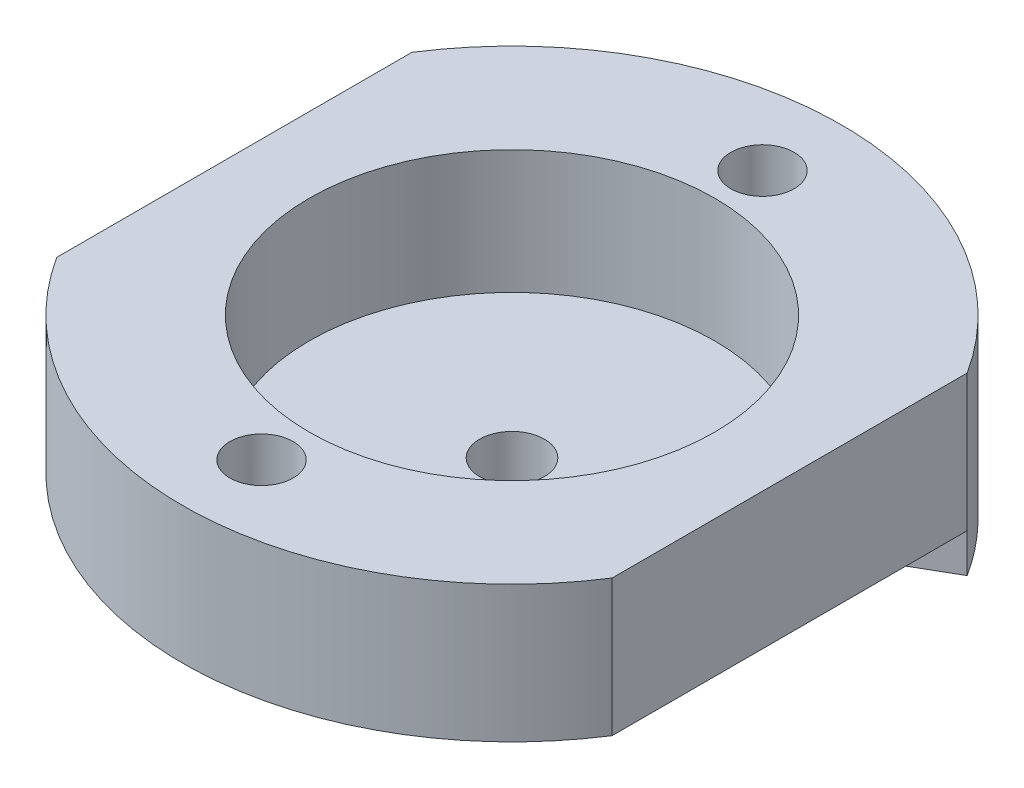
from build123d import *

# Parameters (mm, degrees)
SKETCH1_R             = 12.7
SKETCH1_R_2           = 7.8105
BOSS_EXTRUDE1_DEPTH   = 4.762500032
BOSS_EXTRUDE2_START   = 0.5
SKETCH6_R             = 12.7
BOSS_EXTRUDE2_DEPTH   = 0.5
SKETCH7_R             = 1.25
CUT_EXTRUDE1_DEPTH    = 19.715605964
BOSS_EXTRUDE3_START   = 1.5
SKETCH8_R             = 2.25
SKETCH8_R_2           = 1.25
BOSS_EXTRUDE3_DEPTH   = 1.5
CHAMFER1_SIZE         = 0.5
F_2_CLEARANCE_HOLE1_D = 2.4384
CIRPATTERN2_COUNT     = 2
CUT_EXTRUDE2_DEPTH    = 20.191440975
BOSS_EXTRUDE4_REACH   = 19.421
CUT_EXTRUDE3_DEPTH    = 1.5
BOSS_EXTRUDE6_DEPTH   = 1.5
BOSS_EXTRUDE7_START   = 1.5
BOSS_EXTRUDE7_DEPTH   = 1.5
CUT_EXTRUDE4_DEPTH    = 1.5


with BuildPart() as part:
    # Sketch1 → Boss-Extrude1 (new body)
    with BuildSketch(Plane(origin=(0, 0, 0), x_dir=(1, 0, 0), z_dir=(0, 1, 0))):
        with Locations(Location((0, 0, 0), (0, 0, 270))):
            Circle(SKETCH1_R)
        with Locations(Location((0, 0, 0), (0, 0, 270))):
            Circle(SKETCH1_R_2, mode=Mode.SUBTRACT)
    extrude(amount=BOSS_EXTRUDE1_DEPTH)

    # Sketch6 → Boss-Extrude2 (add)
    with BuildSketch(Plane.XZ.offset(BOSS_EXTRUDE2_START)):
        with Locations(Location((0, 0, 0), (0, 0, 270))):
            Circle(SKETCH6_R)
    extrude(amount=-BOSS_EXTRUDE2_DEPTH)

    # Sketch7 → Cut-Extrude1 (cut, through all)
    with BuildSketch(Plane.XZ.offset(0.5)):
        with Locations(Location((0, 0, 0), (0, 0, 270))):
            Circle(SKETCH7_R)
    extrude(amount=-CUT_EXTRUDE1_DEPTH, mode=Mode.SUBTRACT)

    # Sketch8 → Boss-Extrude3 (add)
    with BuildSketch(Plane.XZ.offset(0.5).offset(BOSS_EXTRUDE3_START)):
        with Locations(Location((0, 0, 0), (0, 0, 270))):
            Circle(SKETCH8_R)
        with Locations(Location((0, 0, 0), (0, 0, 270))):
            Circle(SKETCH8_R_2, mode=Mode.SUBTRACT)
    extrude(amount=-BOSS_EXTRUDE3_DEPTH)

    # Chamfer1
    chamfer1_edges = [part.edges().sort_by_distance(p)[0] for p in [
        (0, -2, 2.25),
    ]]
    chamfer(chamfer1_edges, length=CHAMFER1_SIZE)

    # 2 Clearance Hole1 (through all)
    with Locations(Plane(origin=(0, 4.762500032, 9.652), x_dir=(0, 0, 1), z_dir=(0, 1, 0))):
        with Locations((0, 0)):
            f_2_clearance_hole1 = Hole(F_2_CLEARANCE_HOLE1_D / 2)

    # CirPattern2: 2 Clearance Hole1 ×2 about axis
    cirpattern2_axis = Axis((0, 0, 0), (0, 1, 0))
    for i in range(1, CIRPATTERN2_COUNT):
        add(f_2_clearance_hole1.rotate(cirpattern2_axis, i * 360 / CIRPATTERN2_COUNT), mode=Mode.SUBTRACT)

    # Sketch9 → Cut-Extrude2 (cut, through all)
    with BuildSketch(Plane(origin=(0, 4.762500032, 0), x_dir=(1, 0, 0), z_dir=(0, 1, 0))):
        with BuildLine():
            Line((-10.7, 6.841052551), (-10.7, -6.841052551))
            ThreePointArc((-10.7, -6.841052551), (-12.7, 0), (-10.7, 6.841052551))
        make_face()
        with BuildLine():
            Line((10.7, -6.841052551), (10.7, 6.841052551))
            ThreePointArc((10.7, 6.841052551), (12.7, 0), (10.7, -6.841052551))
        make_face()
    extrude(amount=-CUT_EXTRUDE2_DEPTH, mode=Mode.SUBTRACT)

    # Boss-Extrude4: up to this face of the body (flat: up to its plane)
    boss_extrude4_end = Plane(part.part.faces().sort_by_distance((0, -2, 1.700502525))[0])
    # Sketch10 → Boss-Extrude4 (add, up to the picked face)
    with BuildSketch(Plane.XZ.offset(0.5), mode=Mode.PRIVATE) as boss_extrude4_sk1:
        with BuildLine():
            Line((-10.7, -1.524), (-0.860188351, -1.524))
            ThreePointArc((-0.860188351, -1.524), (-1.75, 0), (-0.860188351, 1.524))
            Line((-0.860188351, 1.524), (-10.7, 1.524))
            Line((-10.7, 1.524), (-10.7, -1.524))
        make_face()
    boss_extrude4_tool1 = split(extrude(boss_extrude4_sk1.sketch, amount=BOSS_EXTRUDE4_REACH, mode=Mode.PRIVATE), bisect_by=boss_extrude4_end, keep=Keep.BOTH, mode=Mode.PRIVATE)
    add(boss_extrude4_tool1.solids().sort_by(Axis((-6.092664, -0.5, 0), (0, -1, 0)))[0])

    # Sketch11 → Cut-Extrude3 (cut)
    with BuildSketch(Plane.XZ.offset(2)):
        with BuildLine():
            Line((-10.7, 3.175), (-5.85, 3.175))
            ThreePointArc((-5.85, 3.175), (-4.789339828, 2.735660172), (-4.35, 1.675))
            Line((-4.35, 1.675), (-4.35, -1.675))
            ThreePointArc((-4.35, -1.675), (-4.789339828, -2.735660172), (-5.85, -3.175))
            Line((-5.85, -3.175), (-10.7, -3.175))
            Line((-10.7, -3.175), (-10.7, 3.175))
        make_face()
    extrude(amount=-CUT_EXTRUDE3_DEPTH, mode=Mode.SUBTRACT)

    # Sketch16 → Boss-Extrude6 (add)
    with BuildSketch(Plane.XZ.offset(0.5)):
        with BuildLine():
            Line((-5.376166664, 1.524), (-5.376166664, 4.257815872))
            ThreePointArc((-5.376166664, 4.257815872), (6.858, 0), (-5.376166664, -4.257815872))
            Line((-5.376166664, -4.257815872), (-5.376166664, -1.524))
            ThreePointArc((-5.376166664, -1.524), (5.588, 0), (-5.376166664, 1.524))
        make_face()
    extrude(amount=BOSS_EXTRUDE6_DEPTH)

    # Sketch17 → Boss-Extrude7 (add)
    with BuildSketch(Plane.XZ.offset(0.5).offset(BOSS_EXTRUDE7_START)):
        with BuildLine():
            Line((10.7, -6.841052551), (5.631061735, -3.914499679))
            ThreePointArc((5.631061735, -3.914499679), (4.638527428, -5.051358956), (3.421368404, -5.943601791))
            Line((3.421368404, -5.943601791), (5.906181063, -11.243087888))
            ThreePointArc((5.906181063, -11.243087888), (8.589865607, -9.354368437), (10.7, -6.841052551))
        make_face()
    extrude(amount=-BOSS_EXTRUDE7_DEPTH)

    # Sketch18 → Cut-Extrude4 (cut)
    with BuildSketch(Plane.XZ.offset(2)):
        with BuildLine():
            Line((4.329859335, -3.532430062), (9.162057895, -8.794696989))
            ThreePointArc((9.162057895, -8.794696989), (8.589865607, -9.354368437), (7.983554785, -9.876884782))
            Line((7.983554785, -9.876884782), (3.151356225, -4.614617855))
            ThreePointArc((3.151356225, -4.614617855), (3.779540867, -4.115922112), (4.329859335, -3.532430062))
        make_face()
    extrude(amount=-CUT_EXTRUDE4_DEPTH, mode=Mode.SUBTRACT)


solid = part.part
